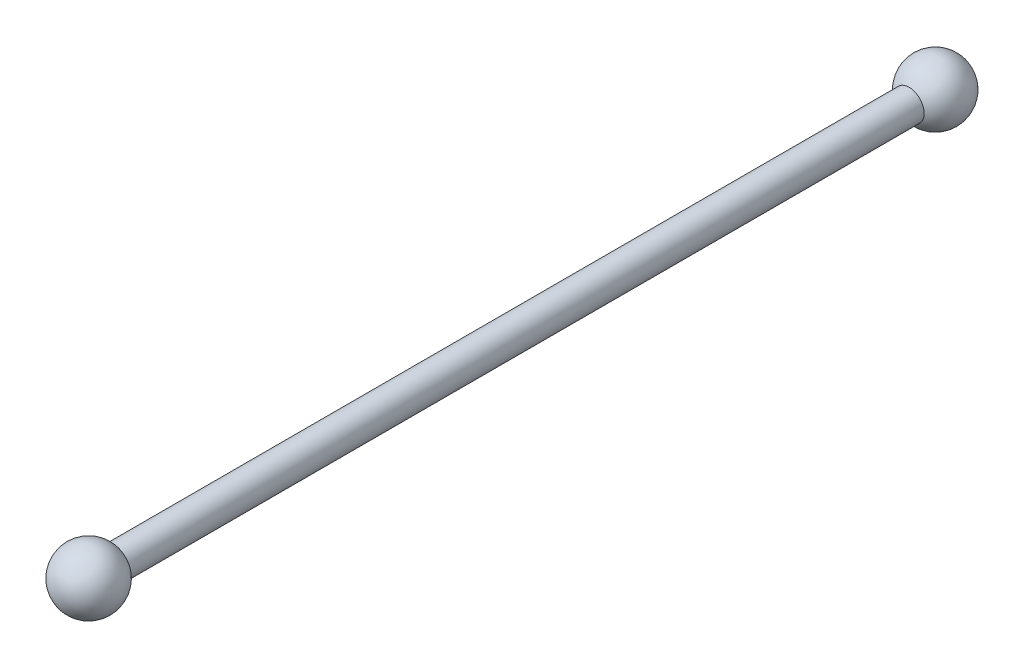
from build123d import *

# Parameters (mm, degrees)
SKETCH2_R           = 25
BOSS_EXTRUDE1_DEPTH = 700


with BuildPart() as part:
    # Sketch2 → Boss-Extrude1 (new, symmetric)
    with BuildSketch(Plane.XY):
        Circle(SKETCH2_R)
    extrude(amount=BOSS_EXTRUDE1_DEPTH, both=True)

    # Sketch3 → Revolve1 (revolve)
    with BuildSketch(Plane(origin=(0, 0, 0), x_dir=(1, 0, 0), z_dir=(0, 1, 0))):
        with BuildLine():
            Line((0, -650), (0, -750))
            ThreePointArc((0, -750), (50, -700), (0, -650))
        make_face()
    revolve1 = revolve(axis=Axis((0, 0, 650), (0, 0, 1)))

    # Mirror1: Revolve1 across plane
    add(revolve1.mirror(Plane.XY))


solid = part.part
